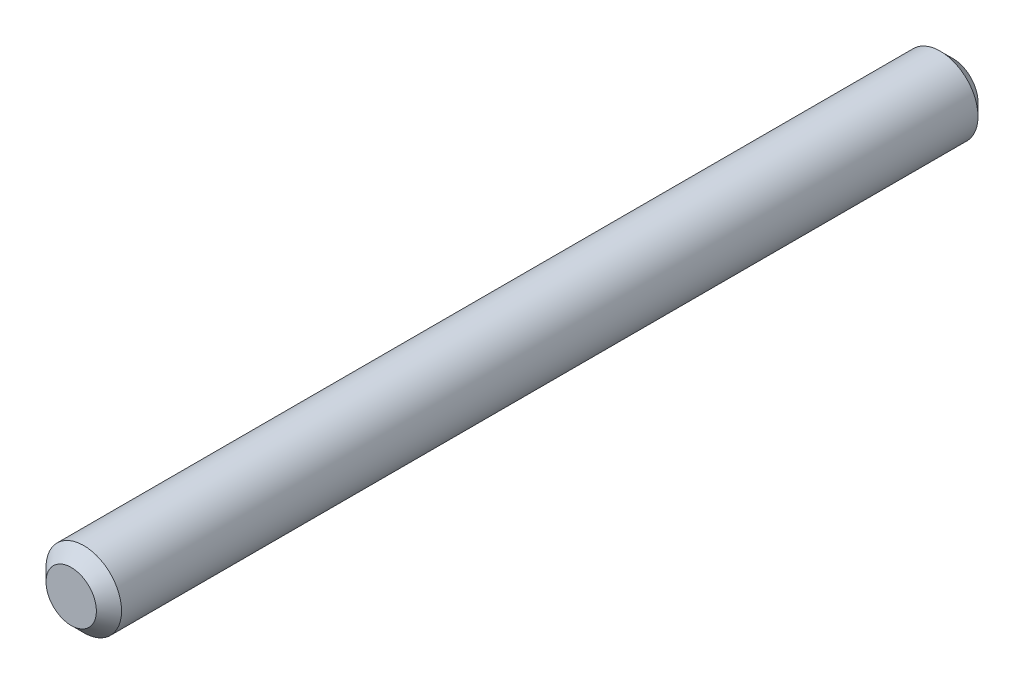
from build123d import *

# Parameters (mm, degrees)
ESQUISSE1_R      = 1.5
EXTRUSION1_DEPTH = 35
CHANFREIN1_SIZE  = 0.5


with BuildPart() as part:
    # Esquisse1 → Extrusion1 (new body)
    with BuildSketch(Plane.XY):
        Circle(ESQUISSE1_R)
    extrude(amount=EXTRUSION1_DEPTH)

    # Chanfrein1
    chanfrein1_edges = [part.edges().sort_by_distance(p)[0] for p in [
        (-1.5, 0, 0),
        (-1.5, 0, 35),
    ]]
    chamfer(chanfrein1_edges, length=CHANFREIN1_SIZE)


solid = part.part
